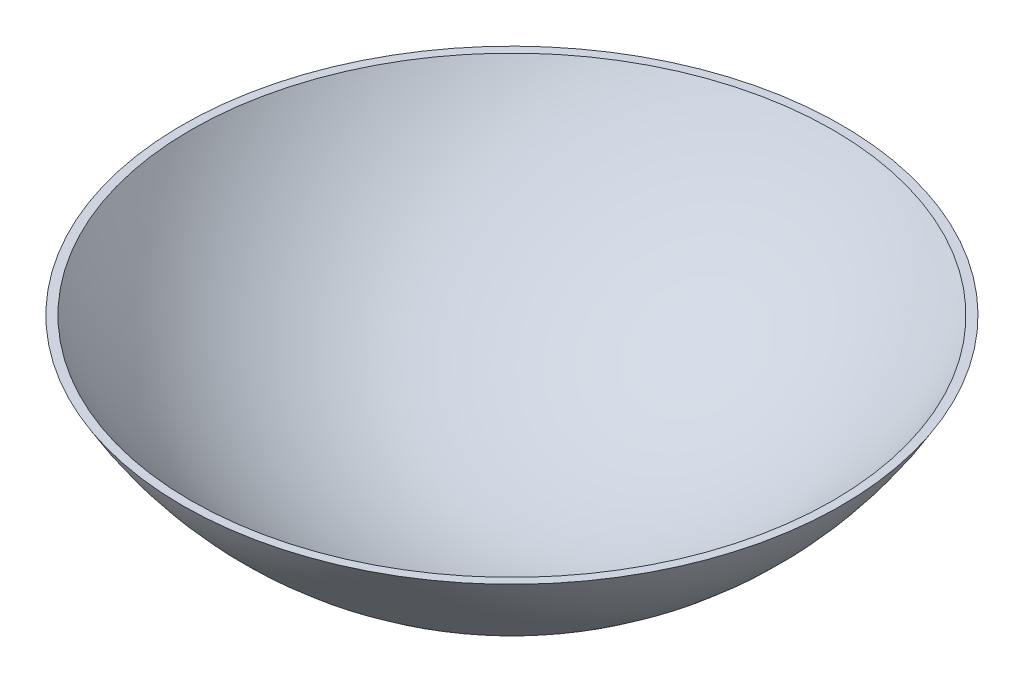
ISO-10303-21;
HEADER;
FILE_DESCRIPTION(('STEP AP214'),'2;1');
FILE_NAME('part.step','',(''),(''),'','','');
FILE_SCHEMA(('AUTOMOTIVE_DESIGN { 1 0 10303 214 1 1 1 1 }'));
ENDSEC;
DATA;
#1=APPLICATION_CONTEXT('core data for automotive mechanical design processes');
#2=APPLICATION_PROTOCOL_DEFINITION('international standard','automotive_design',2000,#1);
#3=PRODUCT_CONTEXT('',#1,'mechanical');
#4=PRODUCT('Part','Part','',(#3));
#5=PRODUCT_RELATED_PRODUCT_CATEGORY('part','',(#4));
#6=PRODUCT_DEFINITION_FORMATION('','',#4);
#7=PRODUCT_DEFINITION_CONTEXT('part definition',#1,'design');
#8=PRODUCT_DEFINITION('design','',#6,#7);
#9=PRODUCT_DEFINITION_SHAPE('','',#8);
#10=(LENGTH_UNIT() NAMED_UNIT(*) SI_UNIT(.MILLI.,.METRE.));
#11=(NAMED_UNIT(*) PLANE_ANGLE_UNIT() SI_UNIT($,.RADIAN.));
#12=(NAMED_UNIT(*) SI_UNIT($,.STERADIAN.) SOLID_ANGLE_UNIT());
#13=UNCERTAINTY_MEASURE_WITH_UNIT(LENGTH_MEASURE(1.E-05),#10,'distance_accuracy_value','');
#14=(GEOMETRIC_REPRESENTATION_CONTEXT(3) GLOBAL_UNCERTAINTY_ASSIGNED_CONTEXT((#13)) GLOBAL_UNIT_ASSIGNED_CONTEXT((#10,
#11,#12)) REPRESENTATION_CONTEXT('',''));
#15=CARTESIAN_POINT('',(0.,0.,0.));
#16=DIRECTION('',(0.,0.,1.));
#17=DIRECTION('',(1.,0.,0.));
#18=AXIS2_PLACEMENT_3D('',#15,#16,#17);
#19=CARTESIAN_POINT('',(0.,0.,0.));
#20=DIRECTION('',(0.,1.,0.));
#21=DIRECTION('',(1.,0.,0.));
#22=AXIS2_PLACEMENT_3D('',#19,#20,#21);
#23=SPHERICAL_SURFACE('',#22,50.);
#24=CARTESIAN_POINT('',(0.,-49.9999999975,0.));
#25=DIRECTION('',(0.,1.,0.));
#26=DIRECTION('',(0.,0.,1.));
#27=AXIS2_PLACEMENT_3D('',#24,#25,#26);
#28=CIRCLE('',#27,0.000500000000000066);
#29=CARTESIAN_POINT('',(0.,-49.9999999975,0.000500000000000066));
#30=VERTEX_POINT('',#29);
#31=EDGE_CURVE('E39',#30,#30,#28,.F.);
#32=ORIENTED_EDGE('',*,*,#31,.T.);
#33=EDGE_LOOP('',(#32));
#34=FACE_BOUND('',#33,.T.);
#35=CARTESIAN_POINT('',(0.,-25.,0.));
#36=DIRECTION('',(0.,1.,0.));
#37=DIRECTION('',(0.,0.,1.));
#38=AXIS2_PLACEMENT_3D('',#35,#36,#37);
#39=CIRCLE('',#38,43.3012701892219);
#40=CARTESIAN_POINT('',(0.,-25.,43.3012701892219));
#41=VERTEX_POINT('',#40);
#42=EDGE_CURVE('E35',#41,#41,#39,.T.);
#43=ORIENTED_EDGE('',*,*,#42,.T.);
#44=EDGE_LOOP('',(#43));
#45=FACE_BOUND('',#44,.T.);
#46=ADVANCED_FACE('F29',(#34,#45),#23,.F.);
#47=CARTESIAN_POINT('',(0.,0.,0.));
#48=DIRECTION('',(0.,1.,0.));
#49=DIRECTION('',(1.,0.,0.));
#50=AXIS2_PLACEMENT_3D('',#47,#48,#49);
#51=SPHERICAL_SURFACE('',#50,51.);
#52=CARTESIAN_POINT('',(0.,-51.,0.));
#53=DIRECTION('',(0.,1.,0.));
#54=DIRECTION('',(0.,0.,1.));
#55=AXIS2_PLACEMENT_3D('',#52,#53,#54);
#56=CIRCLE('',#55,0.000500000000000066);
#57=CARTESIAN_POINT('',(0.,-51.,0.000500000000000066));
#58=VERTEX_POINT('',#57);
#59=EDGE_CURVE('E43',#58,#58,#56,.T.);
#60=ORIENTED_EDGE('',*,*,#59,.T.);
#61=EDGE_LOOP('',(#60));
#62=FACE_BOUND('',#61,.T.);
#63=CARTESIAN_POINT('',(0.,-25.,0.));
#64=DIRECTION('',(0.,1.,0.));
#65=DIRECTION('',(0.,0.,1.));
#66=AXIS2_PLACEMENT_3D('',#63,#64,#65);
#67=CIRCLE('',#66,44.4522215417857);
#68=CARTESIAN_POINT('',(0.,-25.,44.4522215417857));
#69=VERTEX_POINT('',#68);
#70=EDGE_CURVE('E10',#69,#69,#67,.T.);
#71=ORIENTED_EDGE('',*,*,#70,.F.);
#72=EDGE_LOOP('',(#71));
#73=FACE_BOUND('',#72,.T.);
#74=ADVANCED_FACE('F49',(#62,#73),#51,.T.);
#75=CARTESIAN_POINT('',(43.3012701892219,-25.,0.));
#76=DIRECTION('',(0.,-1.,0.));
#77=DIRECTION('',(0.,0.,-1.));
#78=AXIS2_PLACEMENT_3D('',#75,#76,#77);
#79=PLANE('',#78);
#80=ORIENTED_EDGE('',*,*,#42,.F.);
#81=EDGE_LOOP('',(#80));
#82=FACE_BOUND('',#81,.T.);
#83=ORIENTED_EDGE('',*,*,#70,.T.);
#84=EDGE_LOOP('',(#83));
#85=FACE_BOUND('',#84,.T.);
#86=ADVANCED_FACE('F55',(#82,#85),#79,.F.);
#87=CARTESIAN_POINT('',(0.,-51.,0.));
#88=DIRECTION('',(0.,1.,0.));
#89=DIRECTION('',(0.,0.,1.));
#90=AXIS2_PLACEMENT_3D('',#87,#88,#89);
#91=CYLINDRICAL_SURFACE('',#90,0.000500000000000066);
#92=ORIENTED_EDGE('',*,*,#59,.F.);
#93=EDGE_LOOP('',(#92));
#94=FACE_BOUND('',#93,.T.);
#95=ORIENTED_EDGE('',*,*,#31,.F.);
#96=EDGE_LOOP('',(#95));
#97=FACE_BOUND('',#96,.T.);
#98=ADVANCED_FACE('F52',(#94,#97),#91,.F.);
#99=CLOSED_SHELL('',(#46,#74,#86,#98));
#100=MANIFOLD_SOLID_BREP('B2',#99);
#101=ADVANCED_BREP_SHAPE_REPRESENTATION('',(#18,#100),#14);
#102=SHAPE_DEFINITION_REPRESENTATION(#9,#101);
ENDSEC;
END-ISO-10303-21;
